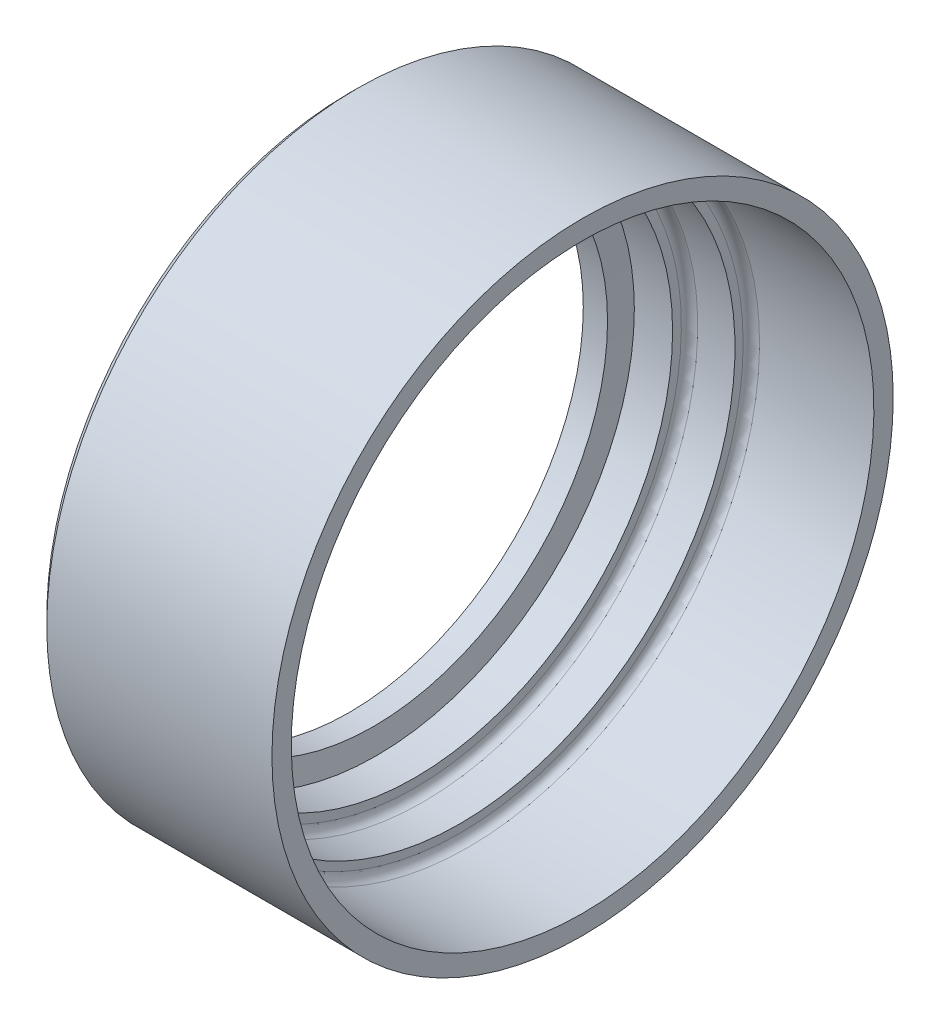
ISO-10303-21;
HEADER;
FILE_DESCRIPTION(('STEP AP214'),'2;1');
FILE_NAME('part.step','',(''),(''),'','','');
FILE_SCHEMA(('AUTOMOTIVE_DESIGN { 1 0 10303 214 1 1 1 1 }'));
ENDSEC;
DATA;
#1=APPLICATION_CONTEXT('core data for automotive mechanical design processes');
#2=APPLICATION_PROTOCOL_DEFINITION('international standard','automotive_design',2000,#1);
#3=PRODUCT_CONTEXT('',#1,'mechanical');
#4=PRODUCT('Part','Part','',(#3));
#5=PRODUCT_RELATED_PRODUCT_CATEGORY('part','',(#4));
#6=PRODUCT_DEFINITION_FORMATION('','',#4);
#7=PRODUCT_DEFINITION_CONTEXT('part definition',#1,'design');
#8=PRODUCT_DEFINITION('design','',#6,#7);
#9=PRODUCT_DEFINITION_SHAPE('','',#8);
#10=(LENGTH_UNIT() NAMED_UNIT(*) SI_UNIT(.MILLI.,.METRE.));
#11=(NAMED_UNIT(*) PLANE_ANGLE_UNIT() SI_UNIT($,.RADIAN.));
#12=(NAMED_UNIT(*) SI_UNIT($,.STERADIAN.) SOLID_ANGLE_UNIT());
#13=UNCERTAINTY_MEASURE_WITH_UNIT(LENGTH_MEASURE(1.E-05),#10,'distance_accuracy_value','');
#14=(GEOMETRIC_REPRESENTATION_CONTEXT(3) GLOBAL_UNCERTAINTY_ASSIGNED_CONTEXT((#13)) GLOBAL_UNIT_ASSIGNED_CONTEXT((#10,
#11,#12)) REPRESENTATION_CONTEXT('',''));
#15=CARTESIAN_POINT('',(0.,0.,0.));
#16=DIRECTION('',(0.,0.,1.));
#17=DIRECTION('',(1.,0.,0.));
#18=AXIS2_PLACEMENT_3D('',#15,#16,#17);
#19=CARTESIAN_POINT('',(-284.831028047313,22.7017764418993,0.));
#20=DIRECTION('',(1.,0.,0.));
#21=DIRECTION('',(0.,1.,0.));
#22=AXIS2_PLACEMENT_3D('',#19,#20,#21);
#23=PLANE('',#22);
#24=CARTESIAN_POINT('',(-284.831028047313,1.66995097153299E-13,0.));
#25=DIRECTION('',(1.,0.,0.));
#26=DIRECTION('',(0.,1.,0.));
#27=AXIS2_PLACEMENT_3D('',#24,#25,#26);
#28=CIRCLE('',#27,29.3368150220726);
#29=CARTESIAN_POINT('',(-284.831028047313,29.3368150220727,0.));
#30=VERTEX_POINT('',#29);
#31=EDGE_CURVE('E47',#30,#30,#28,.F.);
#32=ORIENTED_EDGE('',*,*,#31,.T.);
#33=EDGE_LOOP('',(#32));
#34=FACE_BOUND('',#33,.T.);
#35=CARTESIAN_POINT('',(-284.831028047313,1.66995097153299E-13,0.));
#36=DIRECTION('',(-1.,0.,0.));
#37=DIRECTION('',(0.,-1.,0.));
#38=AXIS2_PLACEMENT_3D('',#35,#36,#37);
#39=CIRCLE('',#38,22.7017764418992);
#40=CARTESIAN_POINT('',(-284.831028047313,-22.701776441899,0.));
#41=VERTEX_POINT('',#40);
#42=EDGE_CURVE('E84',#41,#41,#39,.T.);
#43=ORIENTED_EDGE('',*,*,#42,.F.);
#44=EDGE_LOOP('',(#43));
#45=FACE_BOUND('',#44,.T.);
#46=ADVANCED_FACE('F40',(#34,#45),#23,.F.);
#47=CARTESIAN_POINT('',(-283.82629503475,1.65586394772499E-13,0.));
#48=DIRECTION('',(-1.,0.,0.));
#49=DIRECTION('',(0.,-1.,0.));
#50=AXIS2_PLACEMENT_3D('',#47,#48,#49);
#51=CYLINDRICAL_SURFACE('',#50,30.1305650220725);
#52=CARTESIAN_POINT('',(-284.037278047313,1.65882206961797E-13,0.));
#53=DIRECTION('',(1.,0.,0.));
#54=DIRECTION('',(0.,1.,0.));
#55=AXIS2_PLACEMENT_3D('',#52,#53,#54);
#56=CIRCLE('',#55,30.1305650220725);
#57=CARTESIAN_POINT('',(-284.037278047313,30.1305650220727,0.));
#58=VERTEX_POINT('',#57);
#59=EDGE_CURVE('E12',#58,#58,#56,.T.);
#60=ORIENTED_EDGE('',*,*,#59,.T.);
#61=EDGE_LOOP('',(#60));
#62=FACE_BOUND('',#61,.T.);
#63=CARTESIAN_POINT('',(-262.198353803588,1.35262585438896E-13,0.));
#64=DIRECTION('',(-1.,0.,0.));
#65=DIRECTION('',(0.,-1.,0.));
#66=AXIS2_PLACEMENT_3D('',#63,#64,#65);
#67=CIRCLE('',#66,30.1305650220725);
#68=CARTESIAN_POINT('',(-262.198353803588,-30.1305650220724,0.));
#69=VERTEX_POINT('',#68);
#70=EDGE_CURVE('E66',#69,#69,#67,.T.);
#71=ORIENTED_EDGE('',*,*,#70,.T.);
#72=EDGE_LOOP('',(#71));
#73=FACE_BOUND('',#72,.T.);
#74=ADVANCED_FACE('F91',(#62,#73),#51,.T.);
#75=CARTESIAN_POINT('',(-262.198353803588,30.1305650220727,0.));
#76=DIRECTION('',(-1.,0.,0.));
#77=DIRECTION('',(0.,-1.,0.));
#78=AXIS2_PLACEMENT_3D('',#75,#76,#77);
#79=PLANE('',#78);
#80=ORIENTED_EDGE('',*,*,#70,.F.);
#81=EDGE_LOOP('',(#80));
#82=FACE_BOUND('',#81,.T.);
#83=CARTESIAN_POINT('',(-262.198353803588,1.35262585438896E-13,0.));
#84=DIRECTION('',(-1.,0.,0.));
#85=DIRECTION('',(0.,-1.,0.));
#86=AXIS2_PLACEMENT_3D('',#83,#84,#85);
#87=CIRCLE('',#86,28.2548387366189);
#88=CARTESIAN_POINT('',(-262.198353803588,-28.2548387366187,0.));
#89=VERTEX_POINT('',#88);
#90=EDGE_CURVE('E69',#89,#89,#87,.T.);
#91=ORIENTED_EDGE('',*,*,#90,.T.);
#92=EDGE_LOOP('',(#91));
#93=FACE_BOUND('',#92,.T.);
#94=ADVANCED_FACE('F96',(#82,#93),#79,.F.);
#95=CARTESIAN_POINT('',(-283.82629503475,1.65586394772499E-13,0.));
#96=DIRECTION('',(-1.,0.,0.));
#97=DIRECTION('',(0.,-1.,0.));
#98=AXIS2_PLACEMENT_3D('',#95,#96,#97);
#99=CYLINDRICAL_SURFACE('',#98,28.2548387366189);
#100=CARTESIAN_POINT('',(-273.290894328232,1.50815063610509E-13,0.));
#101=DIRECTION('',(-1.,0.,0.));
#102=DIRECTION('',(0.,-1.,0.));
#103=AXIS2_PLACEMENT_3D('',#100,#101,#102);
#104=CIRCLE('',#103,28.2548387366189);
#105=CARTESIAN_POINT('',(-273.290894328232,-28.2548387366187,0.));
#106=VERTEX_POINT('',#105);
#107=EDGE_CURVE('E55',#106,#106,#104,.T.);
#108=ORIENTED_EDGE('',*,*,#107,.T.);
#109=EDGE_LOOP('',(#108));
#110=FACE_BOUND('',#109,.T.);
#111=ORIENTED_EDGE('',*,*,#90,.F.);
#112=EDGE_LOOP('',(#111));
#113=FACE_BOUND('',#112,.T.);
#114=ADVANCED_FACE('F114',(#110,#113),#99,.F.);
#115=CARTESIAN_POINT('',(-274.084644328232,28.254838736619,0.));
#116=DIRECTION('',(-1.,0.,0.));
#117=DIRECTION('',(0.,-1.,0.));
#118=AXIS2_PLACEMENT_3D('',#115,#116,#117);
#119=PLANE('',#118);
#120=CARTESIAN_POINT('',(-274.084644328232,1.51927953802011E-13,0.));
#121=DIRECTION('',(-1.,0.,0.));
#122=DIRECTION('',(0.,-1.,0.));
#123=AXIS2_PLACEMENT_3D('',#120,#121,#122);
#124=CIRCLE('',#123,27.4610887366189);
#125=CARTESIAN_POINT('',(-274.084644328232,-27.4610887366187,0.));
#126=VERTEX_POINT('',#125);
#127=EDGE_CURVE('E51',#126,#126,#124,.F.);
#128=ORIENTED_EDGE('',*,*,#127,.T.);
#129=EDGE_LOOP('',(#128));
#130=FACE_BOUND('',#129,.T.);
#131=CARTESIAN_POINT('',(-274.084644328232,1.51927953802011E-13,0.));
#132=DIRECTION('',(-1.,0.,0.));
#133=DIRECTION('',(0.,-1.,0.));
#134=AXIS2_PLACEMENT_3D('',#131,#132,#133);
#135=CIRCLE('',#134,26.6699999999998);
#136=CARTESIAN_POINT('',(-274.084644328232,-26.6699999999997,0.));
#137=VERTEX_POINT('',#136);
#138=EDGE_CURVE('E72',#137,#137,#135,.T.);
#139=ORIENTED_EDGE('',*,*,#138,.T.);
#140=EDGE_LOOP('',(#139));
#141=FACE_BOUND('',#140,.T.);
#142=ADVANCED_FACE('F117',(#130,#141),#119,.F.);
#143=CARTESIAN_POINT('',(-283.82629503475,1.65586394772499E-13,0.));
#144=DIRECTION('',(-1.,0.,0.));
#145=DIRECTION('',(0.,-1.,0.));
#146=AXIS2_PLACEMENT_3D('',#143,#144,#145);
#147=CYLINDRICAL_SURFACE('',#146,26.6699999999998);
#148=CARTESIAN_POINT('',(-277.698727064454,1.56995137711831E-13,0.));
#149=DIRECTION('',(-1.,0.,0.));
#150=DIRECTION('',(0.,-1.,0.));
#151=AXIS2_PLACEMENT_3D('',#148,#149,#150);
#152=CIRCLE('',#151,26.6699999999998);
#153=CARTESIAN_POINT('',(-277.698727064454,-26.6699999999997,0.));
#154=VERTEX_POINT('',#153);
#155=EDGE_CURVE('E63',#154,#154,#152,.T.);
#156=ORIENTED_EDGE('',*,*,#155,.T.);
#157=EDGE_LOOP('',(#156));
#158=FACE_BOUND('',#157,.T.);
#159=ORIENTED_EDGE('',*,*,#138,.F.);
#160=EDGE_LOOP('',(#159));
#161=FACE_BOUND('',#160,.T.);
#162=ADVANCED_FACE('F129',(#158,#161),#147,.F.);
#163=CARTESIAN_POINT('',(-278.492477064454,26.67,0.));
#164=DIRECTION('',(-1.,0.,0.));
#165=DIRECTION('',(0.,-1.,0.));
#166=AXIS2_PLACEMENT_3D('',#163,#164,#165);
#167=PLANE('',#166);
#168=CARTESIAN_POINT('',(-278.492477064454,1.58108027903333E-13,0.));
#169=DIRECTION('',(-1.,0.,0.));
#170=DIRECTION('',(0.,-1.,0.));
#171=AXIS2_PLACEMENT_3D('',#168,#169,#170);
#172=CIRCLE('',#171,25.8762499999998);
#173=CARTESIAN_POINT('',(-278.492477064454,-25.8762499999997,0.));
#174=VERTEX_POINT('',#173);
#175=EDGE_CURVE('E60',#174,#174,#172,.F.);
#176=ORIENTED_EDGE('',*,*,#175,.T.);
#177=EDGE_LOOP('',(#176));
#178=FACE_BOUND('',#177,.T.);
#179=CARTESIAN_POINT('',(-278.492477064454,1.58108027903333E-13,0.));
#180=DIRECTION('',(-1.,0.,0.));
#181=DIRECTION('',(0.,-1.,0.));
#182=AXIS2_PLACEMENT_3D('',#179,#180,#181);
#183=CIRCLE('',#182,25.0249999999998);
#184=CARTESIAN_POINT('',(-278.492477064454,-25.0249999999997,0.));
#185=VERTEX_POINT('',#184);
#186=EDGE_CURVE('E75',#185,#185,#183,.T.);
#187=ORIENTED_EDGE('',*,*,#186,.T.);
#188=EDGE_LOOP('',(#187));
#189=FACE_BOUND('',#188,.T.);
#190=ADVANCED_FACE('F133',(#178,#189),#167,.F.);
#191=CARTESIAN_POINT('',(-283.82629503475,1.65586394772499E-13,0.));
#192=DIRECTION('',(-1.,0.,0.));
#193=DIRECTION('',(0.,-1.,0.));
#194=AXIS2_PLACEMENT_3D('',#191,#192,#193);
#195=CYLINDRICAL_SURFACE('',#194,25.0249999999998);
#196=ORIENTED_EDGE('',*,*,#186,.F.);
#197=EDGE_LOOP('',(#196));
#198=FACE_BOUND('',#197,.T.);
#199=CARTESIAN_POINT('',(-282.202304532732,1.63309452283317E-13,0.));
#200=DIRECTION('',(-1.,0.,0.));
#201=DIRECTION('',(0.,-1.,0.));
#202=AXIS2_PLACEMENT_3D('',#199,#200,#201);
#203=CIRCLE('',#202,25.0249999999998);
#204=CARTESIAN_POINT('',(-282.202304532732,-25.0249999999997,0.));
#205=VERTEX_POINT('',#204);
#206=EDGE_CURVE('E78',#205,#205,#203,.T.);
#207=ORIENTED_EDGE('',*,*,#206,.T.);
#208=EDGE_LOOP('',(#207));
#209=FACE_BOUND('',#208,.T.);
#210=ADVANCED_FACE('F137',(#198,#209),#195,.F.);
#211=CARTESIAN_POINT('',(-282.479028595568,1.63697437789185E-13,0.));
#212=DIRECTION('',(1.,0.,0.));
#213=DIRECTION('',(0.,1.,0.));
#214=AXIS2_PLACEMENT_3D('',#211,#212,#213);
#215=CONICAL_SURFACE('',#214,22.7017764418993,1.45224277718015);
#216=ORIENTED_EDGE('',*,*,#206,.F.);
#217=EDGE_LOOP('',(#216));
#218=FACE_BOUND('',#217,.T.);
#219=CARTESIAN_POINT('',(-282.479028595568,1.63697437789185E-13,0.));
#220=DIRECTION('',(-1.,0.,0.));
#221=DIRECTION('',(0.,-1.,0.));
#222=AXIS2_PLACEMENT_3D('',#219,#220,#221);
#223=CIRCLE('',#222,22.7017764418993);
#224=CARTESIAN_POINT('',(-282.479028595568,-22.7017764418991,0.));
#225=VERTEX_POINT('',#224);
#226=EDGE_CURVE('E81',#225,#225,#223,.T.);
#227=ORIENTED_EDGE('',*,*,#226,.T.);
#228=EDGE_LOOP('',(#227));
#229=FACE_BOUND('',#228,.T.);
#230=ADVANCED_FACE('F141',(#218,#229),#215,.F.);
#231=CARTESIAN_POINT('',(-283.82629503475,1.65586394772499E-13,0.));
#232=DIRECTION('',(-1.,0.,0.));
#233=DIRECTION('',(0.,-1.,0.));
#234=AXIS2_PLACEMENT_3D('',#231,#232,#233);
#235=CYLINDRICAL_SURFACE('',#234,22.7017764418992);
#236=ORIENTED_EDGE('',*,*,#226,.F.);
#237=EDGE_LOOP('',(#236));
#238=FACE_BOUND('',#237,.T.);
#239=ORIENTED_EDGE('',*,*,#42,.T.);
#240=EDGE_LOOP('',(#239));
#241=FACE_BOUND('',#240,.T.);
#242=ADVANCED_FACE('F88',(#238,#241),#235,.F.);
#243=CARTESIAN_POINT('',(-277.698727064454,1.56995137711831E-13,0.));
#244=DIRECTION('',(-1.,0.,0.));
#245=DIRECTION('',(0.,-1.,0.));
#246=AXIS2_PLACEMENT_3D('',#243,#244,#245);
#247=TOROIDAL_SURFACE('',#246,25.8762499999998,0.79375);
#248=ORIENTED_EDGE('',*,*,#175,.F.);
#249=EDGE_LOOP('',(#248));
#250=FACE_BOUND('',#249,.T.);
#251=ORIENTED_EDGE('',*,*,#155,.F.);
#252=EDGE_LOOP('',(#251));
#253=FACE_BOUND('',#252,.T.);
#254=ADVANCED_FACE('F100',(#250,#253),#247,.F.);
#255=CARTESIAN_POINT('',(-273.290894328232,1.50815063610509E-13,0.));
#256=DIRECTION('',(-1.,0.,0.));
#257=DIRECTION('',(0.,-1.,0.));
#258=AXIS2_PLACEMENT_3D('',#255,#256,#257);
#259=TOROIDAL_SURFACE('',#258,27.4610887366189,0.79375);
#260=ORIENTED_EDGE('',*,*,#127,.F.);
#261=EDGE_LOOP('',(#260));
#262=FACE_BOUND('',#261,.T.);
#263=ORIENTED_EDGE('',*,*,#107,.F.);
#264=EDGE_LOOP('',(#263));
#265=FACE_BOUND('',#264,.T.);
#266=ADVANCED_FACE('F102',(#262,#265),#259,.F.);
#267=CARTESIAN_POINT('',(-284.831028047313,1.66995097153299E-13,0.));
#268=DIRECTION('',(1.,0.,0.));
#269=DIRECTION('',(0.,1.,0.));
#270=AXIS2_PLACEMENT_3D('',#267,#268,#269);
#271=CONICAL_SURFACE('',#270,29.3368150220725,0.785398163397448);
#272=ORIENTED_EDGE('',*,*,#59,.F.);
#273=EDGE_LOOP('',(#272));
#274=FACE_BOUND('',#273,.T.);
#275=ORIENTED_EDGE('',*,*,#31,.F.);
#276=EDGE_LOOP('',(#275));
#277=FACE_BOUND('',#276,.T.);
#278=ADVANCED_FACE('F42',(#274,#277),#271,.T.);
#279=CLOSED_SHELL('',(#46,#74,#94,#114,#142,#162,#190,#210,#230,#242,#254,#266,#278));
#280=MANIFOLD_SOLID_BREP('B2',#279);
#281=ADVANCED_BREP_SHAPE_REPRESENTATION('',(#18,#280),#14);
#282=SHAPE_DEFINITION_REPRESENTATION(#9,#281);
ENDSEC;
END-ISO-10303-21;
